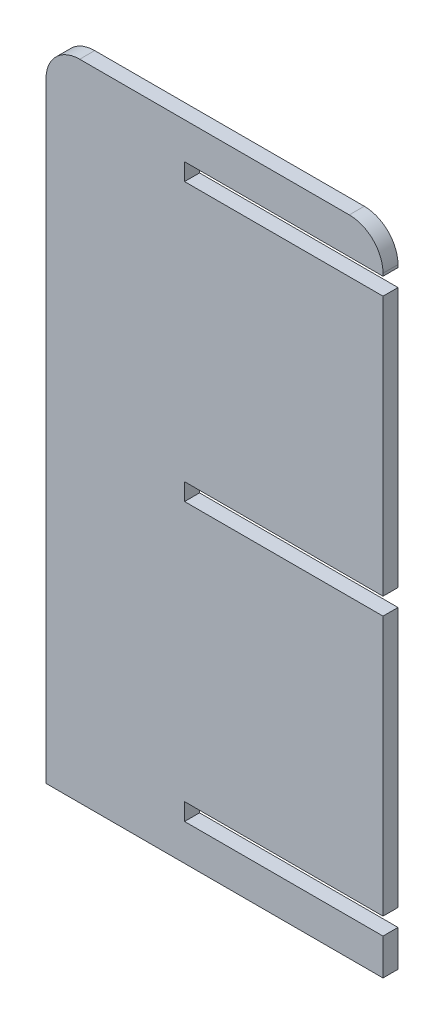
ISO-10303-21;
HEADER;
FILE_DESCRIPTION(('STEP AP214'),'2;1');
FILE_NAME('part.step','',(''),(''),'','','');
FILE_SCHEMA(('AUTOMOTIVE_DESIGN { 1 0 10303 214 1 1 1 1 }'));
ENDSEC;
DATA;
#1=APPLICATION_CONTEXT('core data for automotive mechanical design processes');
#2=APPLICATION_PROTOCOL_DEFINITION('international standard','automotive_design',2000,#1);
#3=PRODUCT_CONTEXT('',#1,'mechanical');
#4=PRODUCT('Part','Part','',(#3));
#5=PRODUCT_RELATED_PRODUCT_CATEGORY('part','',(#4));
#6=PRODUCT_DEFINITION_FORMATION('','',#4);
#7=PRODUCT_DEFINITION_CONTEXT('part definition',#1,'design');
#8=PRODUCT_DEFINITION('design','',#6,#7);
#9=PRODUCT_DEFINITION_SHAPE('','',#8);
#10=(LENGTH_UNIT() NAMED_UNIT(*) SI_UNIT(.MILLI.,.METRE.));
#11=(NAMED_UNIT(*) PLANE_ANGLE_UNIT() SI_UNIT($,.RADIAN.));
#12=(NAMED_UNIT(*) SI_UNIT($,.STERADIAN.) SOLID_ANGLE_UNIT());
#13=UNCERTAINTY_MEASURE_WITH_UNIT(LENGTH_MEASURE(1.E-05),#10,'distance_accuracy_value','');
#14=(GEOMETRIC_REPRESENTATION_CONTEXT(3) GLOBAL_UNCERTAINTY_ASSIGNED_CONTEXT((#13)) GLOBAL_UNIT_ASSIGNED_CONTEXT((#10,
#11,#12)) REPRESENTATION_CONTEXT('',''));
#15=CARTESIAN_POINT('',(0.,0.,0.));
#16=DIRECTION('',(0.,0.,1.));
#17=DIRECTION('',(1.,0.,0.));
#18=AXIS2_PLACEMENT_3D('',#15,#16,#17);
#19=CARTESIAN_POINT('',(-222.670481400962,165.207556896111,20.));
#20=DIRECTION('',(1.,0.,0.));
#21=DIRECTION('',(0.,1.,0.));
#22=AXIS2_PLACEMENT_3D('',#19,#20,#21);
#23=PLANE('',#22);
#24=DIRECTION('',(0.,-1.,0.));
#25=VECTOR('',#24,1.);
#26=CARTESIAN_POINT('',(-222.670481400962,165.207556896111,0.));
#27=LINE('',#26,#25);
#28=CARTESIAN_POINT('',(-222.670481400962,165.207556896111,0.));
#29=VERTEX_POINT('',#28);
#30=CARTESIAN_POINT('',(-222.670481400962,-649.792443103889,0.));
#31=VERTEX_POINT('',#30);
#32=EDGE_CURVE('E188',#29,#31,#27,.T.);
#33=ORIENTED_EDGE('',*,*,#32,.T.);
#34=DIRECTION('',(0.,0.,-1.));
#35=VECTOR('',#34,1.);
#36=CARTESIAN_POINT('',(-222.670481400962,-649.792443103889,20.));
#37=LINE('',#36,#35);
#38=CARTESIAN_POINT('',(-222.670481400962,-649.792443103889,20.));
#39=VERTEX_POINT('',#38);
#40=EDGE_CURVE('E11',#39,#31,#37,.T.);
#41=ORIENTED_EDGE('',*,*,#40,.F.);
#42=DIRECTION('',(0.,-1.,0.));
#43=VECTOR('',#42,1.);
#44=CARTESIAN_POINT('',(-222.670481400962,165.207556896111,20.));
#45=LINE('',#44,#43);
#46=CARTESIAN_POINT('',(-222.670481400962,165.207556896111,20.));
#47=VERTEX_POINT('',#46);
#48=EDGE_CURVE('E222',#47,#39,#45,.T.);
#49=ORIENTED_EDGE('',*,*,#48,.F.);
#50=DIRECTION('',(0.,0.,-1.));
#51=VECTOR('',#50,1.);
#52=CARTESIAN_POINT('',(-222.670481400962,165.207556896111,20.));
#53=LINE('',#52,#51);
#54=EDGE_CURVE('E184',#47,#29,#53,.T.);
#55=ORIENTED_EDGE('',*,*,#54,.T.);
#56=EDGE_LOOP('',(#33,#41,#49,#55));
#57=FACE_BOUND('',#56,.T.);
#58=ADVANCED_FACE('F32',(#57),#23,.F.);
#59=CARTESIAN_POINT('',(-222.670481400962,-649.792443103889,20.));
#60=DIRECTION('',(0.,1.,0.));
#61=DIRECTION('',(0.,0.,1.));
#62=AXIS2_PLACEMENT_3D('',#59,#60,#61);
#63=PLANE('',#62);
#64=DIRECTION('',(1.,0.,0.));
#65=VECTOR('',#64,1.);
#66=CARTESIAN_POINT('',(-222.670481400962,-649.792443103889,0.));
#67=LINE('',#66,#65);
#68=CARTESIAN_POINT('',(227.329518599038,-649.792443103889,0.));
#69=VERTEX_POINT('',#68);
#70=EDGE_CURVE('E191',#31,#69,#67,.T.);
#71=ORIENTED_EDGE('',*,*,#70,.T.);
#72=DIRECTION('',(0.,0.,-1.));
#73=VECTOR('',#72,1.);
#74=CARTESIAN_POINT('',(227.329518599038,-649.792443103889,20.));
#75=LINE('',#74,#73);
#76=CARTESIAN_POINT('',(227.329518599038,-649.792443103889,20.));
#77=VERTEX_POINT('',#76);
#78=EDGE_CURVE('E40',#77,#69,#75,.T.);
#79=ORIENTED_EDGE('',*,*,#78,.F.);
#80=DIRECTION('',(1.,0.,0.));
#81=VECTOR('',#80,1.);
#82=CARTESIAN_POINT('',(-222.670481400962,-649.792443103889,20.));
#83=LINE('',#82,#81);
#84=EDGE_CURVE('E121',#39,#77,#83,.T.);
#85=ORIENTED_EDGE('',*,*,#84,.F.);
#86=ORIENTED_EDGE('',*,*,#40,.T.);
#87=EDGE_LOOP('',(#71,#79,#85,#86));
#88=FACE_BOUND('',#87,.T.);
#89=ADVANCED_FACE('F330',(#88),#63,.F.);
#90=CARTESIAN_POINT('',(227.329518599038,-649.792443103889,20.));
#91=DIRECTION('',(-1.,0.,0.));
#92=DIRECTION('',(0.,-1.,0.));
#93=AXIS2_PLACEMENT_3D('',#90,#91,#92);
#94=PLANE('',#93);
#95=DIRECTION('',(0.,1.,0.));
#96=VECTOR('',#95,1.);
#97=CARTESIAN_POINT('',(227.329518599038,-649.792443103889,0.));
#98=LINE('',#97,#96);
#99=CARTESIAN_POINT('',(227.329518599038,-601.292443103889,0.));
#100=VERTEX_POINT('',#99);
#101=EDGE_CURVE('E193',#69,#100,#98,.T.);
#102=ORIENTED_EDGE('',*,*,#101,.T.);
#103=DIRECTION('',(0.,0.,-1.));
#104=VECTOR('',#103,1.);
#105=CARTESIAN_POINT('',(227.329518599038,-601.292443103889,20.));
#106=LINE('',#105,#104);
#107=CARTESIAN_POINT('',(227.329518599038,-601.292443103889,20.));
#108=VERTEX_POINT('',#107);
#109=EDGE_CURVE('E259',#108,#100,#106,.T.);
#110=ORIENTED_EDGE('',*,*,#109,.F.);
#111=DIRECTION('',(0.,1.,0.));
#112=VECTOR('',#111,1.);
#113=CARTESIAN_POINT('',(227.329518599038,-649.792443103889,20.));
#114=LINE('',#113,#112);
#115=EDGE_CURVE('E267',#77,#108,#114,.T.);
#116=ORIENTED_EDGE('',*,*,#115,.F.);
#117=ORIENTED_EDGE('',*,*,#78,.T.);
#118=EDGE_LOOP('',(#102,#110,#116,#117));
#119=FACE_BOUND('',#118,.T.);
#120=ADVANCED_FACE('F265',(#119),#94,.F.);
#121=CARTESIAN_POINT('',(227.329518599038,-601.292443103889,20.));
#122=DIRECTION('',(0.,-1.,0.));
#123=DIRECTION('',(0.,0.,-1.));
#124=AXIS2_PLACEMENT_3D('',#121,#122,#123);
#125=PLANE('',#124);
#126=DIRECTION('',(-1.,0.,0.));
#127=VECTOR('',#126,1.);
#128=CARTESIAN_POINT('',(227.329518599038,-601.292443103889,0.));
#129=LINE('',#128,#127);
#130=CARTESIAN_POINT('',(-37.6704814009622,-601.292443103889,0.));
#131=VERTEX_POINT('',#130);
#132=EDGE_CURVE('E195',#100,#131,#129,.T.);
#133=ORIENTED_EDGE('',*,*,#132,.T.);
#134=DIRECTION('',(0.,0.,-1.));
#135=VECTOR('',#134,1.);
#136=CARTESIAN_POINT('',(-37.6704814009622,-601.292443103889,20.));
#137=LINE('',#136,#135);
#138=CARTESIAN_POINT('',(-37.6704814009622,-601.292443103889,20.));
#139=VERTEX_POINT('',#138);
#140=EDGE_CURVE('E256',#139,#131,#137,.T.);
#141=ORIENTED_EDGE('',*,*,#140,.F.);
#142=DIRECTION('',(-1.,0.,0.));
#143=VECTOR('',#142,1.);
#144=CARTESIAN_POINT('',(227.329518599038,-601.292443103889,20.));
#145=LINE('',#144,#143);
#146=EDGE_CURVE('E285',#108,#139,#145,.T.);
#147=ORIENTED_EDGE('',*,*,#146,.F.);
#148=ORIENTED_EDGE('',*,*,#109,.T.);
#149=EDGE_LOOP('',(#133,#141,#147,#148));
#150=FACE_BOUND('',#149,.T.);
#151=ADVANCED_FACE('F276',(#150),#125,.F.);
#152=CARTESIAN_POINT('',(-37.6704814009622,-601.292443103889,20.));
#153=DIRECTION('',(-1.,0.,0.));
#154=DIRECTION('',(0.,-1.,0.));
#155=AXIS2_PLACEMENT_3D('',#152,#153,#154);
#156=PLANE('',#155);
#157=DIRECTION('',(0.,1.,0.));
#158=VECTOR('',#157,1.);
#159=CARTESIAN_POINT('',(-37.6704814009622,-601.292443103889,0.));
#160=LINE('',#159,#158);
#161=CARTESIAN_POINT('',(-37.6704814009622,-578.292443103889,0.));
#162=VERTEX_POINT('',#161);
#163=EDGE_CURVE('E197',#131,#162,#160,.T.);
#164=ORIENTED_EDGE('',*,*,#163,.T.);
#165=DIRECTION('',(0.,0.,-1.));
#166=VECTOR('',#165,1.);
#167=CARTESIAN_POINT('',(-37.6704814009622,-578.292443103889,20.));
#168=LINE('',#167,#166);
#169=CARTESIAN_POINT('',(-37.6704814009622,-578.292443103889,20.));
#170=VERTEX_POINT('',#169);
#171=EDGE_CURVE('E253',#170,#162,#168,.T.);
#172=ORIENTED_EDGE('',*,*,#171,.F.);
#173=DIRECTION('',(0.,1.,0.));
#174=VECTOR('',#173,1.);
#175=CARTESIAN_POINT('',(-37.6704814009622,-601.292443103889,20.));
#176=LINE('',#175,#174);
#177=EDGE_CURVE('E282',#139,#170,#176,.T.);
#178=ORIENTED_EDGE('',*,*,#177,.F.);
#179=ORIENTED_EDGE('',*,*,#140,.T.);
#180=EDGE_LOOP('',(#164,#172,#178,#179));
#181=FACE_BOUND('',#180,.T.);
#182=ADVANCED_FACE('F280',(#181),#156,.F.);
#183=CARTESIAN_POINT('',(-37.6704814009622,-578.292443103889,20.));
#184=DIRECTION('',(0.,1.,0.));
#185=DIRECTION('',(0.,0.,1.));
#186=AXIS2_PLACEMENT_3D('',#183,#184,#185);
#187=PLANE('',#186);
#188=DIRECTION('',(1.,0.,0.));
#189=VECTOR('',#188,1.);
#190=CARTESIAN_POINT('',(-37.6704814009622,-578.292443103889,0.));
#191=LINE('',#190,#189);
#192=CARTESIAN_POINT('',(227.329518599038,-578.292443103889,0.));
#193=VERTEX_POINT('',#192);
#194=EDGE_CURVE('E199',#162,#193,#191,.T.);
#195=ORIENTED_EDGE('',*,*,#194,.T.);
#196=DIRECTION('',(0.,0.,-1.));
#197=VECTOR('',#196,1.);
#198=CARTESIAN_POINT('',(227.329518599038,-578.292443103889,20.));
#199=LINE('',#198,#197);
#200=CARTESIAN_POINT('',(227.329518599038,-578.292443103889,20.));
#201=VERTEX_POINT('',#200);
#202=EDGE_CURVE('E250',#201,#193,#199,.T.);
#203=ORIENTED_EDGE('',*,*,#202,.F.);
#204=DIRECTION('',(1.,0.,0.));
#205=VECTOR('',#204,1.);
#206=CARTESIAN_POINT('',(-37.6704814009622,-578.292443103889,20.));
#207=LINE('',#206,#205);
#208=EDGE_CURVE('E284',#170,#201,#207,.T.);
#209=ORIENTED_EDGE('',*,*,#208,.F.);
#210=ORIENTED_EDGE('',*,*,#171,.T.);
#211=EDGE_LOOP('',(#195,#203,#209,#210));
#212=FACE_BOUND('',#211,.T.);
#213=ADVANCED_FACE('F343',(#212),#187,.F.);
#214=CARTESIAN_POINT('',(227.329518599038,-578.292443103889,20.));
#215=DIRECTION('',(-1.,0.,0.));
#216=DIRECTION('',(0.,-1.,0.));
#217=AXIS2_PLACEMENT_3D('',#214,#215,#216);
#218=PLANE('',#217);
#219=DIRECTION('',(0.,1.,0.));
#220=VECTOR('',#219,1.);
#221=CARTESIAN_POINT('',(227.329518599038,-578.292443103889,0.));
#222=LINE('',#221,#220);
#223=CARTESIAN_POINT('',(227.329518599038,-231.292443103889,0.));
#224=VERTEX_POINT('',#223);
#225=EDGE_CURVE('E201',#193,#224,#222,.T.);
#226=ORIENTED_EDGE('',*,*,#225,.T.);
#227=DIRECTION('',(0.,0.,-1.));
#228=VECTOR('',#227,1.);
#229=CARTESIAN_POINT('',(227.329518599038,-231.292443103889,20.));
#230=LINE('',#229,#228);
#231=CARTESIAN_POINT('',(227.329518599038,-231.292443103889,20.));
#232=VERTEX_POINT('',#231);
#233=EDGE_CURVE('E247',#232,#224,#230,.T.);
#234=ORIENTED_EDGE('',*,*,#233,.F.);
#235=DIRECTION('',(0.,1.,0.));
#236=VECTOR('',#235,1.);
#237=CARTESIAN_POINT('',(227.329518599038,-578.292443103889,20.));
#238=LINE('',#237,#236);
#239=EDGE_CURVE('E287',#201,#232,#238,.T.);
#240=ORIENTED_EDGE('',*,*,#239,.F.);
#241=ORIENTED_EDGE('',*,*,#202,.T.);
#242=EDGE_LOOP('',(#226,#234,#240,#241));
#243=FACE_BOUND('',#242,.T.);
#244=ADVANCED_FACE('F346',(#243),#218,.F.);
#245=CARTESIAN_POINT('',(227.329518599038,-231.292443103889,20.));
#246=DIRECTION('',(0.,-1.,0.));
#247=DIRECTION('',(0.,0.,-1.));
#248=AXIS2_PLACEMENT_3D('',#245,#246,#247);
#249=PLANE('',#248);
#250=DIRECTION('',(-1.,0.,0.));
#251=VECTOR('',#250,1.);
#252=CARTESIAN_POINT('',(227.329518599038,-231.292443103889,0.));
#253=LINE('',#252,#251);
#254=CARTESIAN_POINT('',(-37.6704814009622,-231.292443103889,0.));
#255=VERTEX_POINT('',#254);
#256=EDGE_CURVE('E203',#224,#255,#253,.T.);
#257=ORIENTED_EDGE('',*,*,#256,.T.);
#258=DIRECTION('',(0.,0.,-1.));
#259=VECTOR('',#258,1.);
#260=CARTESIAN_POINT('',(-37.6704814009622,-231.292443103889,20.));
#261=LINE('',#260,#259);
#262=CARTESIAN_POINT('',(-37.6704814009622,-231.292443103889,20.));
#263=VERTEX_POINT('',#262);
#264=EDGE_CURVE('E244',#263,#255,#261,.T.);
#265=ORIENTED_EDGE('',*,*,#264,.F.);
#266=DIRECTION('',(-1.,0.,0.));
#267=VECTOR('',#266,1.);
#268=CARTESIAN_POINT('',(227.329518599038,-231.292443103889,20.));
#269=LINE('',#268,#267);
#270=EDGE_CURVE('E293',#232,#263,#269,.T.);
#271=ORIENTED_EDGE('',*,*,#270,.F.);
#272=ORIENTED_EDGE('',*,*,#233,.T.);
#273=EDGE_LOOP('',(#257,#265,#271,#272));
#274=FACE_BOUND('',#273,.T.);
#275=ADVANCED_FACE('F350',(#274),#249,.F.);
#276=CARTESIAN_POINT('',(-37.6704814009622,-231.292443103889,20.));
#277=DIRECTION('',(-1.,0.,0.));
#278=DIRECTION('',(0.,-1.,0.));
#279=AXIS2_PLACEMENT_3D('',#276,#277,#278);
#280=PLANE('',#279);
#281=DIRECTION('',(0.,1.,0.));
#282=VECTOR('',#281,1.);
#283=CARTESIAN_POINT('',(-37.6704814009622,-231.292443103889,0.));
#284=LINE('',#283,#282);
#285=CARTESIAN_POINT('',(-37.6704814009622,-208.292443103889,0.));
#286=VERTEX_POINT('',#285);
#287=EDGE_CURVE('E205',#255,#286,#284,.T.);
#288=ORIENTED_EDGE('',*,*,#287,.T.);
#289=DIRECTION('',(0.,0.,-1.));
#290=VECTOR('',#289,1.);
#291=CARTESIAN_POINT('',(-37.6704814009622,-208.292443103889,20.));
#292=LINE('',#291,#290);
#293=CARTESIAN_POINT('',(-37.6704814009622,-208.292443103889,20.));
#294=VERTEX_POINT('',#293);
#295=EDGE_CURVE('E241',#294,#286,#292,.T.);
#296=ORIENTED_EDGE('',*,*,#295,.F.);
#297=DIRECTION('',(0.,1.,0.));
#298=VECTOR('',#297,1.);
#299=CARTESIAN_POINT('',(-37.6704814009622,-231.292443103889,20.));
#300=LINE('',#299,#298);
#301=EDGE_CURVE('E295',#263,#294,#300,.T.);
#302=ORIENTED_EDGE('',*,*,#301,.F.);
#303=ORIENTED_EDGE('',*,*,#264,.T.);
#304=EDGE_LOOP('',(#288,#296,#302,#303));
#305=FACE_BOUND('',#304,.T.);
#306=ADVANCED_FACE('F354',(#305),#280,.F.);
#307=CARTESIAN_POINT('',(-37.6704814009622,-208.292443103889,20.));
#308=DIRECTION('',(0.,1.,0.));
#309=DIRECTION('',(0.,0.,1.));
#310=AXIS2_PLACEMENT_3D('',#307,#308,#309);
#311=PLANE('',#310);
#312=DIRECTION('',(1.,0.,0.));
#313=VECTOR('',#312,1.);
#314=CARTESIAN_POINT('',(-37.6704814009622,-208.292443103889,0.));
#315=LINE('',#314,#313);
#316=CARTESIAN_POINT('',(227.329518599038,-208.292443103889,0.));
#317=VERTEX_POINT('',#316);
#318=EDGE_CURVE('E207',#286,#317,#315,.T.);
#319=ORIENTED_EDGE('',*,*,#318,.T.);
#320=DIRECTION('',(0.,0.,-1.));
#321=VECTOR('',#320,1.);
#322=CARTESIAN_POINT('',(227.329518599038,-208.292443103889,20.));
#323=LINE('',#322,#321);
#324=CARTESIAN_POINT('',(227.329518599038,-208.292443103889,20.));
#325=VERTEX_POINT('',#324);
#326=EDGE_CURVE('E238',#325,#317,#323,.T.);
#327=ORIENTED_EDGE('',*,*,#326,.F.);
#328=DIRECTION('',(1.,0.,0.));
#329=VECTOR('',#328,1.);
#330=CARTESIAN_POINT('',(-37.6704814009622,-208.292443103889,20.));
#331=LINE('',#330,#329);
#332=EDGE_CURVE('E297',#294,#325,#331,.T.);
#333=ORIENTED_EDGE('',*,*,#332,.F.);
#334=ORIENTED_EDGE('',*,*,#295,.T.);
#335=EDGE_LOOP('',(#319,#327,#333,#334));
#336=FACE_BOUND('',#335,.T.);
#337=ADVANCED_FACE('F358',(#336),#311,.F.);
#338=CARTESIAN_POINT('',(227.329518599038,-208.292443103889,20.));
#339=DIRECTION('',(-1.,0.,0.));
#340=DIRECTION('',(0.,-1.,0.));
#341=AXIS2_PLACEMENT_3D('',#338,#339,#340);
#342=PLANE('',#341);
#343=DIRECTION('',(0.,1.,0.));
#344=VECTOR('',#343,1.);
#345=CARTESIAN_POINT('',(227.329518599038,-208.292443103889,0.));
#346=LINE('',#345,#344);
#347=CARTESIAN_POINT('',(227.329518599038,138.707556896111,0.));
#348=VERTEX_POINT('',#347);
#349=EDGE_CURVE('E209',#317,#348,#346,.T.);
#350=ORIENTED_EDGE('',*,*,#349,.T.);
#351=DIRECTION('',(0.,0.,-1.));
#352=VECTOR('',#351,1.);
#353=CARTESIAN_POINT('',(227.329518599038,138.707556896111,20.));
#354=LINE('',#353,#352);
#355=CARTESIAN_POINT('',(227.329518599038,138.707556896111,20.));
#356=VERTEX_POINT('',#355);
#357=EDGE_CURVE('E235',#356,#348,#354,.T.);
#358=ORIENTED_EDGE('',*,*,#357,.F.);
#359=DIRECTION('',(0.,1.,0.));
#360=VECTOR('',#359,1.);
#361=CARTESIAN_POINT('',(227.329518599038,-208.292443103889,20.));
#362=LINE('',#361,#360);
#363=EDGE_CURVE('E299',#325,#356,#362,.T.);
#364=ORIENTED_EDGE('',*,*,#363,.F.);
#365=ORIENTED_EDGE('',*,*,#326,.T.);
#366=EDGE_LOOP('',(#350,#358,#364,#365));
#367=FACE_BOUND('',#366,.T.);
#368=ADVANCED_FACE('F362',(#367),#342,.F.);
#369=CARTESIAN_POINT('',(227.329518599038,138.707556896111,20.));
#370=DIRECTION('',(0.,-1.,0.));
#371=DIRECTION('',(0.,0.,-1.));
#372=AXIS2_PLACEMENT_3D('',#369,#370,#371);
#373=PLANE('',#372);
#374=DIRECTION('',(-1.,0.,0.));
#375=VECTOR('',#374,1.);
#376=CARTESIAN_POINT('',(227.329518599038,138.707556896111,0.));
#377=LINE('',#376,#375);
#378=CARTESIAN_POINT('',(-37.6704814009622,138.707556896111,0.));
#379=VERTEX_POINT('',#378);
#380=EDGE_CURVE('E211',#348,#379,#377,.T.);
#381=ORIENTED_EDGE('',*,*,#380,.T.);
#382=DIRECTION('',(0.,0.,-1.));
#383=VECTOR('',#382,1.);
#384=CARTESIAN_POINT('',(-37.6704814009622,138.707556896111,20.));
#385=LINE('',#384,#383);
#386=CARTESIAN_POINT('',(-37.6704814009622,138.707556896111,20.));
#387=VERTEX_POINT('',#386);
#388=EDGE_CURVE('E232',#387,#379,#385,.T.);
#389=ORIENTED_EDGE('',*,*,#388,.F.);
#390=DIRECTION('',(-1.,0.,0.));
#391=VECTOR('',#390,1.);
#392=CARTESIAN_POINT('',(227.329518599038,138.707556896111,20.));
#393=LINE('',#392,#391);
#394=EDGE_CURVE('E301',#356,#387,#393,.T.);
#395=ORIENTED_EDGE('',*,*,#394,.F.);
#396=ORIENTED_EDGE('',*,*,#357,.T.);
#397=EDGE_LOOP('',(#381,#389,#395,#396));
#398=FACE_BOUND('',#397,.T.);
#399=ADVANCED_FACE('F366',(#398),#373,.F.);
#400=CARTESIAN_POINT('',(-37.6704814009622,138.707556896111,20.));
#401=DIRECTION('',(-1.,0.,0.));
#402=DIRECTION('',(0.,0.,1.));
#403=AXIS2_PLACEMENT_3D('',#400,#401,#402);
#404=PLANE('',#403);
#405=DIRECTION('',(0.,1.,0.));
#406=VECTOR('',#405,1.);
#407=CARTESIAN_POINT('',(-37.6704814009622,138.707556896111,0.));
#408=LINE('',#407,#406);
#409=CARTESIAN_POINT('',(-37.6704814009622,161.707556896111,0.));
#410=VERTEX_POINT('',#409);
#411=EDGE_CURVE('E213',#379,#410,#408,.T.);
#412=ORIENTED_EDGE('',*,*,#411,.T.);
#413=DIRECTION('',(0.,0.,-1.));
#414=VECTOR('',#413,1.);
#415=CARTESIAN_POINT('',(-37.6704814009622,161.707556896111,20.));
#416=LINE('',#415,#414);
#417=CARTESIAN_POINT('',(-37.6704814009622,161.707556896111,20.));
#418=VERTEX_POINT('',#417);
#419=EDGE_CURVE('E229',#418,#410,#416,.T.);
#420=ORIENTED_EDGE('',*,*,#419,.F.);
#421=DIRECTION('',(0.,1.,0.));
#422=VECTOR('',#421,1.);
#423=CARTESIAN_POINT('',(-37.6704814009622,138.707556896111,20.));
#424=LINE('',#423,#422);
#425=EDGE_CURVE('E303',#387,#418,#424,.T.);
#426=ORIENTED_EDGE('',*,*,#425,.F.);
#427=ORIENTED_EDGE('',*,*,#388,.T.);
#428=EDGE_LOOP('',(#412,#420,#426,#427));
#429=FACE_BOUND('',#428,.T.);
#430=ADVANCED_FACE('F370',(#429),#404,.F.);
#431=CARTESIAN_POINT('',(-37.6704814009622,161.707556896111,20.));
#432=DIRECTION('',(0.,1.,0.));
#433=DIRECTION('',(0.,0.,1.));
#434=AXIS2_PLACEMENT_3D('',#431,#432,#433);
#435=PLANE('',#434);
#436=DIRECTION('',(1.,0.,0.));
#437=VECTOR('',#436,1.);
#438=CARTESIAN_POINT('',(-37.6704814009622,161.707556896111,0.));
#439=LINE('',#438,#437);
#440=CARTESIAN_POINT('',(227.329518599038,161.707556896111,0.));
#441=VERTEX_POINT('',#440);
#442=EDGE_CURVE('E215',#410,#441,#439,.T.);
#443=ORIENTED_EDGE('',*,*,#442,.T.);
#444=DIRECTION('',(0.,0.,-1.));
#445=VECTOR('',#444,1.);
#446=CARTESIAN_POINT('',(227.329518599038,161.707556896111,20.));
#447=LINE('',#446,#445);
#448=CARTESIAN_POINT('',(227.329518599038,161.707556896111,20.));
#449=VERTEX_POINT('',#448);
#450=EDGE_CURVE('E226',#449,#441,#447,.T.);
#451=ORIENTED_EDGE('',*,*,#450,.F.);
#452=DIRECTION('',(1.,0.,0.));
#453=VECTOR('',#452,1.);
#454=CARTESIAN_POINT('',(-37.6704814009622,161.707556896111,20.));
#455=LINE('',#454,#453);
#456=EDGE_CURVE('E305',#418,#449,#455,.T.);
#457=ORIENTED_EDGE('',*,*,#456,.F.);
#458=ORIENTED_EDGE('',*,*,#419,.T.);
#459=EDGE_LOOP('',(#443,#451,#457,#458));
#460=FACE_BOUND('',#459,.T.);
#461=ADVANCED_FACE('F311',(#460),#435,.F.);
#462=CARTESIAN_POINT('',(227.329518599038,161.707556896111,20.));
#463=DIRECTION('',(-1.,0.,0.));
#464=DIRECTION('',(0.,-1.,0.));
#465=AXIS2_PLACEMENT_3D('',#462,#463,#464);
#466=PLANE('',#465);
#467=DIRECTION('',(0.,1.,0.));
#468=VECTOR('',#467,1.);
#469=CARTESIAN_POINT('',(227.329518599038,161.707556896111,0.));
#470=LINE('',#469,#468);
#471=CARTESIAN_POINT('',(227.329518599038,165.207556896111,0.));
#472=VERTEX_POINT('',#471);
#473=EDGE_CURVE('E217',#441,#472,#470,.T.);
#474=ORIENTED_EDGE('',*,*,#473,.T.);
#475=DIRECTION('',(0.,0.,-1.));
#476=VECTOR('',#475,1.);
#477=CARTESIAN_POINT('',(227.329518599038,165.207556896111,20.));
#478=LINE('',#477,#476);
#479=CARTESIAN_POINT('',(227.329518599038,165.207556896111,20.));
#480=VERTEX_POINT('',#479);
#481=EDGE_CURVE('E179',#480,#472,#478,.T.);
#482=ORIENTED_EDGE('',*,*,#481,.F.);
#483=DIRECTION('',(0.,1.,0.));
#484=VECTOR('',#483,1.);
#485=CARTESIAN_POINT('',(227.329518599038,161.707556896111,20.));
#486=LINE('',#485,#484);
#487=EDGE_CURVE('E170',#449,#480,#486,.T.);
#488=ORIENTED_EDGE('',*,*,#487,.F.);
#489=ORIENTED_EDGE('',*,*,#450,.T.);
#490=EDGE_LOOP('',(#474,#482,#488,#489));
#491=FACE_BOUND('',#490,.T.);
#492=ADVANCED_FACE('F315',(#491),#466,.F.);
#493=CARTESIAN_POINT('',(182.329518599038,165.207556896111,20.));
#494=DIRECTION('',(0.,0.,-1.));
#495=DIRECTION('',(-1.,0.,0.));
#496=AXIS2_PLACEMENT_3D('',#493,#494,#495);
#497=CYLINDRICAL_SURFACE('',#496,45.);
#498=CARTESIAN_POINT('',(182.329518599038,165.207556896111,0.));
#499=DIRECTION('',(0.,0.,1.));
#500=DIRECTION('',(1.,0.,0.));
#501=AXIS2_PLACEMENT_3D('',#498,#499,#500);
#502=CIRCLE('',#501,45.);
#503=CARTESIAN_POINT('',(182.329518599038,210.207556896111,0.));
#504=VERTEX_POINT('',#503);
#505=EDGE_CURVE('E178',#472,#504,#502,.T.);
#506=ORIENTED_EDGE('',*,*,#505,.T.);
#507=DIRECTION('',(0.,0.,-1.));
#508=VECTOR('',#507,1.);
#509=CARTESIAN_POINT('',(182.329518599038,210.207556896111,20.));
#510=LINE('',#509,#508);
#511=CARTESIAN_POINT('',(182.329518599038,210.207556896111,20.));
#512=VERTEX_POINT('',#511);
#513=EDGE_CURVE('E175',#512,#504,#510,.T.);
#514=ORIENTED_EDGE('',*,*,#513,.F.);
#515=CARTESIAN_POINT('',(182.329518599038,165.207556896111,20.));
#516=DIRECTION('',(0.,0.,1.));
#517=DIRECTION('',(1.,0.,0.));
#518=AXIS2_PLACEMENT_3D('',#515,#516,#517);
#519=CIRCLE('',#518,45.);
#520=EDGE_CURVE('E164',#480,#512,#519,.T.);
#521=ORIENTED_EDGE('',*,*,#520,.F.);
#522=ORIENTED_EDGE('',*,*,#481,.T.);
#523=EDGE_LOOP('',(#506,#514,#521,#522));
#524=FACE_BOUND('',#523,.T.);
#525=ADVANCED_FACE('F176',(#524),#497,.T.);
#526=CARTESIAN_POINT('',(182.329518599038,210.207556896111,20.));
#527=DIRECTION('',(0.,-1.,0.));
#528=DIRECTION('',(1.,0.,0.));
#529=AXIS2_PLACEMENT_3D('',#526,#527,#528);
#530=PLANE('',#529);
#531=DIRECTION('',(-1.,0.,0.));
#532=VECTOR('',#531,1.);
#533=CARTESIAN_POINT('',(182.329518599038,210.207556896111,0.));
#534=LINE('',#533,#532);
#535=CARTESIAN_POINT('',(-177.670481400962,210.207556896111,0.));
#536=VERTEX_POINT('',#535);
#537=EDGE_CURVE('E107',#504,#536,#534,.T.);
#538=ORIENTED_EDGE('',*,*,#537,.T.);
#539=DIRECTION('',(0.,0.,-1.));
#540=VECTOR('',#539,1.);
#541=CARTESIAN_POINT('',(-177.670481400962,210.207556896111,20.));
#542=LINE('',#541,#540);
#543=CARTESIAN_POINT('',(-177.670481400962,210.207556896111,20.));
#544=VERTEX_POINT('',#543);
#545=EDGE_CURVE('E180',#544,#536,#542,.T.);
#546=ORIENTED_EDGE('',*,*,#545,.F.);
#547=DIRECTION('',(-1.,0.,0.));
#548=VECTOR('',#547,1.);
#549=CARTESIAN_POINT('',(182.329518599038,210.207556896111,20.));
#550=LINE('',#549,#548);
#551=EDGE_CURVE('E168',#512,#544,#550,.T.);
#552=ORIENTED_EDGE('',*,*,#551,.F.);
#553=ORIENTED_EDGE('',*,*,#513,.T.);
#554=EDGE_LOOP('',(#538,#546,#552,#553));
#555=FACE_BOUND('',#554,.T.);
#556=ADVANCED_FACE('F182',(#555),#530,.F.);
#557=CARTESIAN_POINT('',(-177.670481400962,165.207556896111,20.));
#558=DIRECTION('',(0.,0.,-1.));
#559=DIRECTION('',(-1.,0.,0.));
#560=AXIS2_PLACEMENT_3D('',#557,#558,#559);
#561=CYLINDRICAL_SURFACE('',#560,45.);
#562=CARTESIAN_POINT('',(-177.670481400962,165.207556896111,0.));
#563=DIRECTION('',(0.,0.,1.));
#564=DIRECTION('',(1.,0.,0.));
#565=AXIS2_PLACEMENT_3D('',#562,#563,#564);
#566=CIRCLE('',#565,45.);
#567=EDGE_CURVE('E113',#536,#29,#566,.T.);
#568=ORIENTED_EDGE('',*,*,#567,.T.);
#569=ORIENTED_EDGE('',*,*,#54,.F.);
#570=CARTESIAN_POINT('',(-177.670481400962,165.207556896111,20.));
#571=DIRECTION('',(0.,0.,1.));
#572=DIRECTION('',(1.,0.,0.));
#573=AXIS2_PLACEMENT_3D('',#570,#571,#572);
#574=CIRCLE('',#573,45.);
#575=EDGE_CURVE('E48',#544,#47,#574,.T.);
#576=ORIENTED_EDGE('',*,*,#575,.F.);
#577=ORIENTED_EDGE('',*,*,#545,.T.);
#578=EDGE_LOOP('',(#568,#569,#576,#577));
#579=FACE_BOUND('',#578,.T.);
#580=ADVANCED_FACE('F319',(#579),#561,.T.);
#581=CARTESIAN_POINT('',(182.329518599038,165.207556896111,20.));
#582=DIRECTION('',(0.,0.,1.));
#583=DIRECTION('',(1.,0.,0.));
#584=AXIS2_PLACEMENT_3D('',#581,#582,#583);
#585=PLANE('',#584);
#586=ORIENTED_EDGE('',*,*,#48,.T.);
#587=ORIENTED_EDGE('',*,*,#84,.T.);
#588=ORIENTED_EDGE('',*,*,#115,.T.);
#589=ORIENTED_EDGE('',*,*,#146,.T.);
#590=ORIENTED_EDGE('',*,*,#177,.T.);
#591=ORIENTED_EDGE('',*,*,#208,.T.);
#592=ORIENTED_EDGE('',*,*,#239,.T.);
#593=ORIENTED_EDGE('',*,*,#270,.T.);
#594=ORIENTED_EDGE('',*,*,#301,.T.);
#595=ORIENTED_EDGE('',*,*,#332,.T.);
#596=ORIENTED_EDGE('',*,*,#363,.T.);
#597=ORIENTED_EDGE('',*,*,#394,.T.);
#598=ORIENTED_EDGE('',*,*,#425,.T.);
#599=ORIENTED_EDGE('',*,*,#456,.T.);
#600=ORIENTED_EDGE('',*,*,#487,.T.);
#601=ORIENTED_EDGE('',*,*,#520,.T.);
#602=ORIENTED_EDGE('',*,*,#551,.T.);
#603=ORIENTED_EDGE('',*,*,#575,.T.);
#604=EDGE_LOOP('',(#586,#587,#588,#589,#590,#591,#592,#593,#594,#595,#596,#597,#598,#599,#600,
#601,#602,#603));
#605=FACE_BOUND('',#604,.T.);
#606=ADVANCED_FACE('F166',(#605),#585,.T.);
#607=CARTESIAN_POINT('',(182.329518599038,165.207556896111,0.));
#608=DIRECTION('',(0.,0.,1.));
#609=DIRECTION('',(1.,0.,0.));
#610=AXIS2_PLACEMENT_3D('',#607,#608,#609);
#611=PLANE('',#610);
#612=ORIENTED_EDGE('',*,*,#32,.F.);
#613=ORIENTED_EDGE('',*,*,#567,.F.);
#614=ORIENTED_EDGE('',*,*,#537,.F.);
#615=ORIENTED_EDGE('',*,*,#505,.F.);
#616=ORIENTED_EDGE('',*,*,#473,.F.);
#617=ORIENTED_EDGE('',*,*,#442,.F.);
#618=ORIENTED_EDGE('',*,*,#411,.F.);
#619=ORIENTED_EDGE('',*,*,#380,.F.);
#620=ORIENTED_EDGE('',*,*,#349,.F.);
#621=ORIENTED_EDGE('',*,*,#318,.F.);
#622=ORIENTED_EDGE('',*,*,#287,.F.);
#623=ORIENTED_EDGE('',*,*,#256,.F.);
#624=ORIENTED_EDGE('',*,*,#225,.F.);
#625=ORIENTED_EDGE('',*,*,#194,.F.);
#626=ORIENTED_EDGE('',*,*,#163,.F.);
#627=ORIENTED_EDGE('',*,*,#132,.F.);
#628=ORIENTED_EDGE('',*,*,#101,.F.);
#629=ORIENTED_EDGE('',*,*,#70,.F.);
#630=EDGE_LOOP('',(#612,#613,#614,#615,#616,#617,#618,#619,#620,#621,#622,#623,#624,#625,#626,
#627,#628,#629));
#631=FACE_BOUND('',#630,.T.);
#632=ADVANCED_FACE('F271',(#631),#611,.F.);
#633=CLOSED_SHELL('',(#58,#89,#120,#151,#182,#213,#244,#275,#306,#337,#368,#399,#430,#461,#492,
#525,#556,#580,#606,#632));
#634=MANIFOLD_SOLID_BREP('B2',#633);
#635=ADVANCED_BREP_SHAPE_REPRESENTATION('',(#18,#634),#14);
#636=SHAPE_DEFINITION_REPRESENTATION(#9,#635);
ENDSEC;
END-ISO-10303-21;
